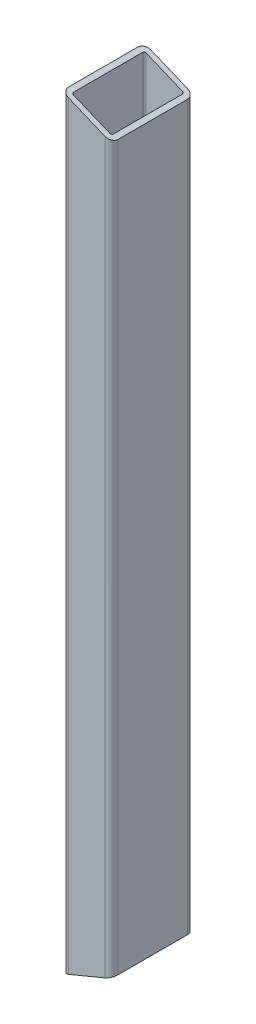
from build123d import *

# Parameters (mm, degrees)
BOSS_EXTRU_1_DEPTH = 3
BOSS_EXTRU_2_DEPTH = 44
BOSS_EXTRU_3_DEPTH = 44
BOSS_EXTRU_4_DEPTH = 3
CONG_1_R           = 1
CONG_2_R           = 4


with BuildPart() as part:
    # Esquisse1 → Boss.-Extru.1 (new body)
    with BuildSketch(Plane.XY.offset(25)):
        Polygon((-15, -231.35), (15, -218.923593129), (15, 218.923593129), (-15, 231.35), align=None)
    extrude(amount=-BOSS_EXTRU_1_DEPTH)

    # Esquisse2 → Boss.-Extru.2 (add)
    with BuildSketch(Plane(origin=(0, 0, 22), x_dir=(-1, 0, 0), z_dir=(0, 0, -1))):
        Polygon((-15, 218.923593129), (-12, 220.166233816), (-12, -220.166233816), (-15, -218.923593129), align=None)
    extrude(amount=BOSS_EXTRU_2_DEPTH)

    # Esquisse3 → Boss.-Extru.3 (add)
    with BuildSketch(Plane(origin=(0, 0, 22), x_dir=(-1, 0, 0), z_dir=(0, 0, -1))):
        Polygon((15, -231.35), (12, -230.107359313), (12, 230.107359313), (15, 231.35), align=None)
    extrude(amount=BOSS_EXTRU_3_DEPTH)

    # Esquisse4 → Boss.-Extru.4 (add)
    with BuildSketch(Plane(origin=(0, 0, -22), x_dir=(-1, 0, 0), z_dir=(0, 0, -1))):
        Polygon((15, -231.35), (-15, -218.923593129), (-15, 218.923593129), (15, 231.35), align=None)
    extrude(amount=BOSS_EXTRU_4_DEPTH)

    # Cong_1
    cong_1_edges = [part.edges().sort_by_distance(p)[0] for p in [
        (12, 0, -22),
        (12, 0, 22),
        (-12, 0, -22),
        (-12, 0, 22),
    ]]
    fillet(cong_1_edges, radius=CONG_1_R)

    # Cong_2
    cong_2_edges = [part.edges().sort_by_distance(p)[0] for p in [
        (-15, 0, -25),
        (15, 0, -25),
        (15, 0, 25),
        (-15, 0, 25),
    ]]
    fillet(cong_2_edges, radius=CONG_2_R)


solid = part.part
